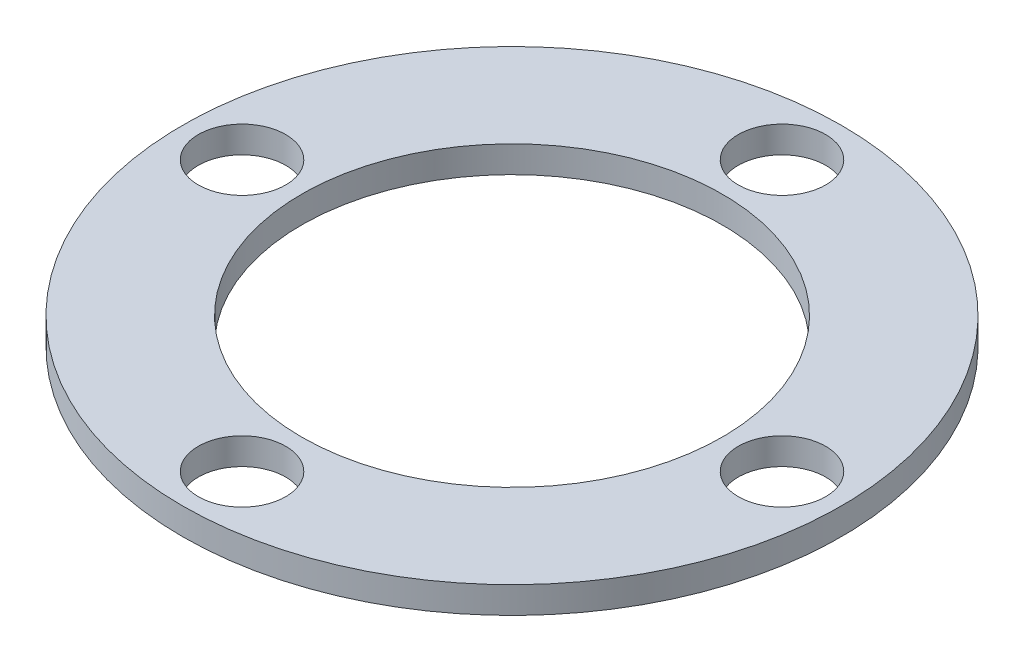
ISO-10303-21;
HEADER;
FILE_DESCRIPTION(('STEP AP214'),'2;1');
FILE_NAME('part.step','',(''),(''),'','','');
FILE_SCHEMA(('AUTOMOTIVE_DESIGN { 1 0 10303 214 1 1 1 1 }'));
ENDSEC;
DATA;
#1=APPLICATION_CONTEXT('core data for automotive mechanical design processes');
#2=APPLICATION_PROTOCOL_DEFINITION('international standard','automotive_design',2000,#1);
#3=PRODUCT_CONTEXT('',#1,'mechanical');
#4=PRODUCT('Part','Part','',(#3));
#5=PRODUCT_RELATED_PRODUCT_CATEGORY('part','',(#4));
#6=PRODUCT_DEFINITION_FORMATION('','',#4);
#7=PRODUCT_DEFINITION_CONTEXT('part definition',#1,'design');
#8=PRODUCT_DEFINITION('design','',#6,#7);
#9=PRODUCT_DEFINITION_SHAPE('','',#8);
#10=(LENGTH_UNIT() NAMED_UNIT(*) SI_UNIT(.MILLI.,.METRE.));
#11=(NAMED_UNIT(*) PLANE_ANGLE_UNIT() SI_UNIT($,.RADIAN.));
#12=(NAMED_UNIT(*) SI_UNIT($,.STERADIAN.) SOLID_ANGLE_UNIT());
#13=UNCERTAINTY_MEASURE_WITH_UNIT(LENGTH_MEASURE(1.E-05),#10,'distance_accuracy_value','');
#14=(GEOMETRIC_REPRESENTATION_CONTEXT(3) GLOBAL_UNCERTAINTY_ASSIGNED_CONTEXT((#13)) GLOBAL_UNIT_ASSIGNED_CONTEXT((#10,
#11,#12)) REPRESENTATION_CONTEXT('',''));
#15=CARTESIAN_POINT('',(0.,0.,0.));
#16=DIRECTION('',(0.,0.,1.));
#17=DIRECTION('',(1.,0.,0.));
#18=AXIS2_PLACEMENT_3D('',#15,#16,#17);
#19=CARTESIAN_POINT('',(0.,2.667,0.));
#20=DIRECTION('',(0.,1.,0.));
#21=DIRECTION('',(0.,0.,1.));
#22=AXIS2_PLACEMENT_3D('',#19,#20,#21);
#23=PLANE('',#22);
#24=CARTESIAN_POINT('',(-26.9875,2.667,-2.79209774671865E-13));
#25=DIRECTION('',(0.,1.,0.));
#26=DIRECTION('',(0.,0.,1.));
#27=AXIS2_PLACEMENT_3D('',#24,#25,#26);
#28=CIRCLE('',#27,4.36880000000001);
#29=CARTESIAN_POINT('',(-26.9875,2.667,4.36879999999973));
#30=VERTEX_POINT('',#29);
#31=EDGE_CURVE('E74',#30,#30,#28,.T.);
#32=ORIENTED_EDGE('',*,*,#31,.F.);
#33=EDGE_LOOP('',(#32));
#34=FACE_BOUND('',#33,.T.);
#35=CARTESIAN_POINT('',(-1.84983367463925E-13,2.667,26.9875));
#36=DIRECTION('',(0.,1.,0.));
#37=DIRECTION('',(0.,0.,1.));
#38=AXIS2_PLACEMENT_3D('',#35,#36,#37);
#39=CIRCLE('',#38,4.36880000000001);
#40=CARTESIAN_POINT('',(-1.84983367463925E-13,2.667,31.3563));
#41=VERTEX_POINT('',#40);
#42=EDGE_CURVE('E68',#41,#41,#39,.T.);
#43=ORIENTED_EDGE('',*,*,#42,.F.);
#44=EDGE_LOOP('',(#43));
#45=FACE_BOUND('',#44,.T.);
#46=CARTESIAN_POINT('',(26.9875,2.667,0.));
#47=DIRECTION('',(0.,1.,0.));
#48=DIRECTION('',(0.,0.,1.));
#49=AXIS2_PLACEMENT_3D('',#46,#47,#48);
#50=CIRCLE('',#49,4.36880000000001);
#51=CARTESIAN_POINT('',(26.9875,2.667,4.3688000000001));
#52=VERTEX_POINT('',#51);
#53=EDGE_CURVE('E62',#52,#52,#50,.T.);
#54=ORIENTED_EDGE('',*,*,#53,.F.);
#55=EDGE_LOOP('',(#54));
#56=FACE_BOUND('',#55,.T.);
#57=CARTESIAN_POINT('',(0.,2.667,-26.9875));
#58=DIRECTION('',(0.,1.,0.));
#59=DIRECTION('',(0.,0.,1.));
#60=AXIS2_PLACEMENT_3D('',#57,#58,#59);
#61=CIRCLE('',#60,4.36880000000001);
#62=CARTESIAN_POINT('',(0.,2.667,-22.6187));
#63=VERTEX_POINT('',#62);
#64=EDGE_CURVE('E56',#63,#63,#61,.T.);
#65=ORIENTED_EDGE('',*,*,#64,.F.);
#66=EDGE_LOOP('',(#65));
#67=FACE_BOUND('',#66,.T.);
#68=CARTESIAN_POINT('',(0.,2.667,0.));
#69=DIRECTION('',(0.,1.,0.));
#70=DIRECTION('',(0.,0.,1.));
#71=AXIS2_PLACEMENT_3D('',#68,#69,#70);
#72=CIRCLE('',#71,32.9438);
#73=CARTESIAN_POINT('',(0.,2.667,32.9438));
#74=VERTEX_POINT('',#73);
#75=EDGE_CURVE('E10',#74,#74,#72,.T.);
#76=ORIENTED_EDGE('',*,*,#75,.T.);
#77=EDGE_LOOP('',(#76));
#78=FACE_BOUND('',#77,.T.);
#79=CARTESIAN_POINT('',(0.,2.667,0.));
#80=DIRECTION('',(0.,1.,0.));
#81=DIRECTION('',(0.,0.,1.));
#82=AXIS2_PLACEMENT_3D('',#79,#80,#81);
#83=CIRCLE('',#82,21.0312);
#84=CARTESIAN_POINT('',(0.,2.667,21.0312));
#85=VERTEX_POINT('',#84);
#86=EDGE_CURVE('E46',#85,#85,#83,.T.);
#87=ORIENTED_EDGE('',*,*,#86,.F.);
#88=EDGE_LOOP('',(#87));
#89=FACE_BOUND('',#88,.T.);
#90=ADVANCED_FACE('F35',(#34,#45,#56,#67,#78,#89),#23,.T.);
#91=CARTESIAN_POINT('',(0.,0.,0.));
#92=DIRECTION('',(0.,1.,0.));
#93=DIRECTION('',(0.,0.,1.));
#94=AXIS2_PLACEMENT_3D('',#91,#92,#93);
#95=PLANE('',#94);
#96=CARTESIAN_POINT('',(-26.9875,0.,-2.79209774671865E-13));
#97=DIRECTION('',(0.,1.,0.));
#98=DIRECTION('',(0.,0.,1.));
#99=AXIS2_PLACEMENT_3D('',#96,#97,#98);
#100=CIRCLE('',#99,4.36880000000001);
#101=CARTESIAN_POINT('',(-26.9875,0.,4.36879999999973));
#102=VERTEX_POINT('',#101);
#103=EDGE_CURVE('E71',#102,#102,#100,.T.);
#104=ORIENTED_EDGE('',*,*,#103,.T.);
#105=EDGE_LOOP('',(#104));
#106=FACE_BOUND('',#105,.T.);
#107=CARTESIAN_POINT('',(-1.84983367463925E-13,0.,26.9875));
#108=DIRECTION('',(0.,1.,0.));
#109=DIRECTION('',(0.,0.,1.));
#110=AXIS2_PLACEMENT_3D('',#107,#108,#109);
#111=CIRCLE('',#110,4.36880000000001);
#112=CARTESIAN_POINT('',(-1.84983367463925E-13,0.,31.3563));
#113=VERTEX_POINT('',#112);
#114=EDGE_CURVE('E65',#113,#113,#111,.T.);
#115=ORIENTED_EDGE('',*,*,#114,.T.);
#116=EDGE_LOOP('',(#115));
#117=FACE_BOUND('',#116,.T.);
#118=CARTESIAN_POINT('',(26.9875,0.,0.));
#119=DIRECTION('',(0.,1.,0.));
#120=DIRECTION('',(0.,0.,1.));
#121=AXIS2_PLACEMENT_3D('',#118,#119,#120);
#122=CIRCLE('',#121,4.36880000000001);
#123=CARTESIAN_POINT('',(26.9875,0.,4.3688000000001));
#124=VERTEX_POINT('',#123);
#125=EDGE_CURVE('E59',#124,#124,#122,.T.);
#126=ORIENTED_EDGE('',*,*,#125,.T.);
#127=EDGE_LOOP('',(#126));
#128=FACE_BOUND('',#127,.T.);
#129=CARTESIAN_POINT('',(0.,0.,-26.9875));
#130=DIRECTION('',(0.,1.,0.));
#131=DIRECTION('',(0.,0.,1.));
#132=AXIS2_PLACEMENT_3D('',#129,#130,#131);
#133=CIRCLE('',#132,4.36880000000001);
#134=CARTESIAN_POINT('',(0.,0.,-22.6187));
#135=VERTEX_POINT('',#134);
#136=EDGE_CURVE('E51',#135,#135,#133,.T.);
#137=ORIENTED_EDGE('',*,*,#136,.T.);
#138=EDGE_LOOP('',(#137));
#139=FACE_BOUND('',#138,.T.);
#140=CARTESIAN_POINT('',(0.,0.,0.));
#141=DIRECTION('',(0.,1.,0.));
#142=DIRECTION('',(0.,0.,1.));
#143=AXIS2_PLACEMENT_3D('',#140,#141,#142);
#144=CIRCLE('',#143,32.9438);
#145=CARTESIAN_POINT('',(0.,0.,32.9438));
#146=VERTEX_POINT('',#145);
#147=EDGE_CURVE('E39',#146,#146,#144,.T.);
#148=ORIENTED_EDGE('',*,*,#147,.F.);
#149=EDGE_LOOP('',(#148));
#150=FACE_BOUND('',#149,.T.);
#151=CARTESIAN_POINT('',(0.,0.,0.));
#152=DIRECTION('',(0.,1.,0.));
#153=DIRECTION('',(0.,0.,1.));
#154=AXIS2_PLACEMENT_3D('',#151,#152,#153);
#155=CIRCLE('',#154,21.0312);
#156=CARTESIAN_POINT('',(0.,0.,21.0312));
#157=VERTEX_POINT('',#156);
#158=EDGE_CURVE('E48',#157,#157,#155,.T.);
#159=ORIENTED_EDGE('',*,*,#158,.T.);
#160=EDGE_LOOP('',(#159));
#161=FACE_BOUND('',#160,.T.);
#162=ADVANCED_FACE('F82',(#106,#117,#128,#139,#150,#161),#95,.F.);
#163=CARTESIAN_POINT('',(0.,2.667,0.));
#164=DIRECTION('',(0.,-1.,0.));
#165=DIRECTION('',(0.,0.,-1.));
#166=AXIS2_PLACEMENT_3D('',#163,#164,#165);
#167=CYLINDRICAL_SURFACE('',#166,32.9438);
#168=ORIENTED_EDGE('',*,*,#75,.F.);
#169=EDGE_LOOP('',(#168));
#170=FACE_BOUND('',#169,.T.);
#171=ORIENTED_EDGE('',*,*,#147,.T.);
#172=EDGE_LOOP('',(#171));
#173=FACE_BOUND('',#172,.T.);
#174=ADVANCED_FACE('F37',(#170,#173),#167,.T.);
#175=CARTESIAN_POINT('',(0.,2.667,0.));
#176=DIRECTION('',(0.,-1.,0.));
#177=DIRECTION('',(0.,0.,-1.));
#178=AXIS2_PLACEMENT_3D('',#175,#176,#177);
#179=CYLINDRICAL_SURFACE('',#178,21.0312);
#180=ORIENTED_EDGE('',*,*,#86,.T.);
#181=EDGE_LOOP('',(#180));
#182=FACE_BOUND('',#181,.T.);
#183=ORIENTED_EDGE('',*,*,#158,.F.);
#184=EDGE_LOOP('',(#183));
#185=FACE_BOUND('',#184,.T.);
#186=ADVANCED_FACE('F92',(#182,#185),#179,.F.);
#187=CARTESIAN_POINT('',(0.,2.667,-26.9875));
#188=DIRECTION('',(0.,1.,0.));
#189=DIRECTION('',(0.,0.,1.));
#190=AXIS2_PLACEMENT_3D('',#187,#188,#189);
#191=CYLINDRICAL_SURFACE('',#190,4.36880000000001);
#192=ORIENTED_EDGE('',*,*,#136,.F.);
#193=EDGE_LOOP('',(#192));
#194=FACE_BOUND('',#193,.T.);
#195=ORIENTED_EDGE('',*,*,#64,.T.);
#196=EDGE_LOOP('',(#195));
#197=FACE_BOUND('',#196,.T.);
#198=ADVANCED_FACE('F95',(#194,#197),#191,.F.);
#199=CARTESIAN_POINT('',(26.9875,2.667,0.));
#200=DIRECTION('',(0.,1.,0.));
#201=DIRECTION('',(0.,0.,1.));
#202=AXIS2_PLACEMENT_3D('',#199,#200,#201);
#203=CYLINDRICAL_SURFACE('',#202,4.36880000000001);
#204=ORIENTED_EDGE('',*,*,#125,.F.);
#205=EDGE_LOOP('',(#204));
#206=FACE_BOUND('',#205,.T.);
#207=ORIENTED_EDGE('',*,*,#53,.T.);
#208=EDGE_LOOP('',(#207));
#209=FACE_BOUND('',#208,.T.);
#210=ADVANCED_FACE('F109',(#206,#209),#203,.F.);
#211=CARTESIAN_POINT('',(-1.84983367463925E-13,2.667,26.9875));
#212=DIRECTION('',(0.,1.,0.));
#213=DIRECTION('',(0.,0.,1.));
#214=AXIS2_PLACEMENT_3D('',#211,#212,#213);
#215=CYLINDRICAL_SURFACE('',#214,4.36880000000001);
#216=ORIENTED_EDGE('',*,*,#114,.F.);
#217=EDGE_LOOP('',(#216));
#218=FACE_BOUND('',#217,.T.);
#219=ORIENTED_EDGE('',*,*,#42,.T.);
#220=EDGE_LOOP('',(#219));
#221=FACE_BOUND('',#220,.T.);
#222=ADVANCED_FACE('F113',(#218,#221),#215,.F.);
#223=CARTESIAN_POINT('',(-26.9875,2.667,-2.79209774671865E-13));
#224=DIRECTION('',(0.,1.,0.));
#225=DIRECTION('',(0.,0.,1.));
#226=AXIS2_PLACEMENT_3D('',#223,#224,#225);
#227=CYLINDRICAL_SURFACE('',#226,4.36880000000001);
#228=ORIENTED_EDGE('',*,*,#103,.F.);
#229=EDGE_LOOP('',(#228));
#230=FACE_BOUND('',#229,.T.);
#231=ORIENTED_EDGE('',*,*,#31,.T.);
#232=EDGE_LOOP('',(#231));
#233=FACE_BOUND('',#232,.T.);
#234=ADVANCED_FACE('F78',(#230,#233),#227,.F.);
#235=CLOSED_SHELL('',(#90,#162,#174,#186,#198,#210,#222,#234));
#236=MANIFOLD_SOLID_BREP('B2',#235);
#237=ADVANCED_BREP_SHAPE_REPRESENTATION('',(#18,#236),#14);
#238=SHAPE_DEFINITION_REPRESENTATION(#9,#237);
ENDSEC;
END-ISO-10303-21;
